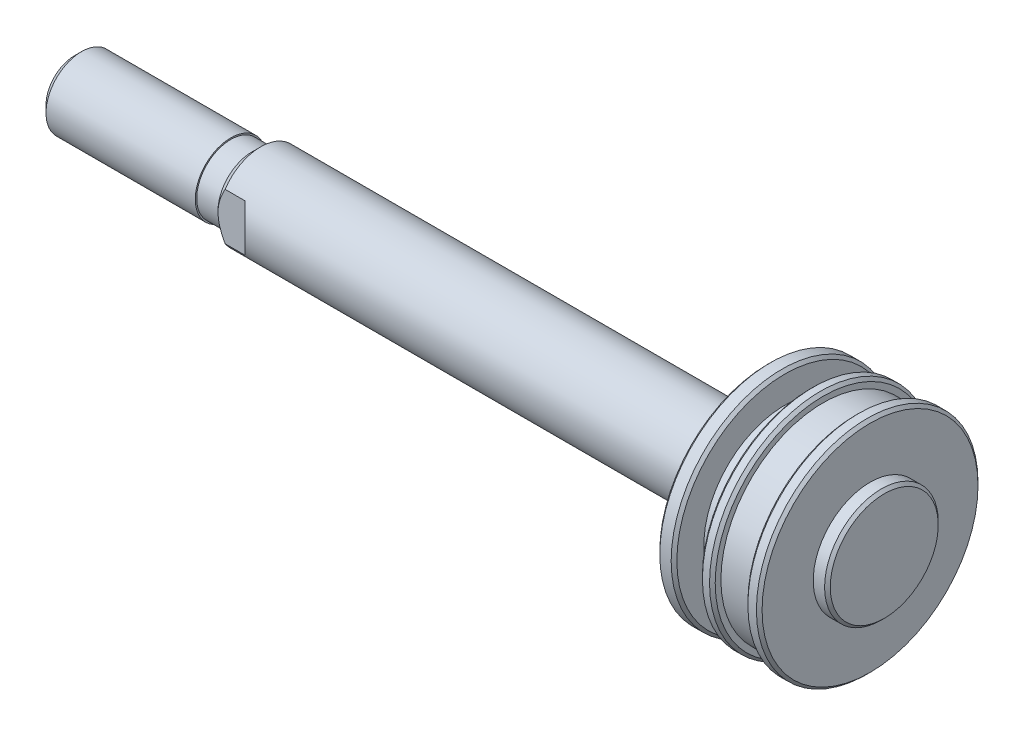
ISO-10303-21;
HEADER;
FILE_DESCRIPTION(('STEP AP214'),'2;1');
FILE_NAME('part.step','',(''),(''),'','','');
FILE_SCHEMA(('AUTOMOTIVE_DESIGN { 1 0 10303 214 1 1 1 1 }'));
ENDSEC;
DATA;
#1=APPLICATION_CONTEXT('core data for automotive mechanical design processes');
#2=APPLICATION_PROTOCOL_DEFINITION('international standard','automotive_design',2000,#1);
#3=PRODUCT_CONTEXT('',#1,'mechanical');
#4=PRODUCT('Part','Part','',(#3));
#5=PRODUCT_RELATED_PRODUCT_CATEGORY('part','',(#4));
#6=PRODUCT_DEFINITION_FORMATION('','',#4);
#7=PRODUCT_DEFINITION_CONTEXT('part definition',#1,'design');
#8=PRODUCT_DEFINITION('design','',#6,#7);
#9=PRODUCT_DEFINITION_SHAPE('','',#8);
#10=(LENGTH_UNIT() NAMED_UNIT(*) SI_UNIT(.MILLI.,.METRE.));
#11=(NAMED_UNIT(*) PLANE_ANGLE_UNIT() SI_UNIT($,.RADIAN.));
#12=(NAMED_UNIT(*) SI_UNIT($,.STERADIAN.) SOLID_ANGLE_UNIT());
#13=UNCERTAINTY_MEASURE_WITH_UNIT(LENGTH_MEASURE(1.E-05),#10,'distance_accuracy_value','');
#14=(GEOMETRIC_REPRESENTATION_CONTEXT(3) GLOBAL_UNCERTAINTY_ASSIGNED_CONTEXT((#13)) GLOBAL_UNIT_ASSIGNED_CONTEXT((#10,
#11,#12)) REPRESENTATION_CONTEXT('',''));
#15=CARTESIAN_POINT('',(0.,0.,0.));
#16=DIRECTION('',(0.,0.,1.));
#17=DIRECTION('',(1.,0.,0.));
#18=AXIS2_PLACEMENT_3D('',#15,#16,#17);
#19=CARTESIAN_POINT('',(41.,0.,1.9));
#20=DIRECTION('',(1.,0.,0.));
#21=DIRECTION('',(0.,0.,-1.));
#22=AXIS2_PLACEMENT_3D('',#19,#20,#21);
#23=PLANE('',#22);
#24=CARTESIAN_POINT('',(40.9999999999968,0.,0.));
#25=DIRECTION('',(-1.,0.,0.));
#26=DIRECTION('',(0.,0.,1.));
#27=AXIS2_PLACEMENT_3D('',#24,#25,#26);
#28=CIRCLE('',#27,3.80000000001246);
#29=CARTESIAN_POINT('',(40.9999999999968,0.,3.80000000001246));
#30=VERTEX_POINT('',#29);
#31=EDGE_CURVE('E19',#30,#30,#28,.T.);
#32=ORIENTED_EDGE('',*,*,#31,.F.);
#33=EDGE_LOOP('',(#32));
#34=FACE_BOUND('',#33,.T.);
#35=ADVANCED_FACE('F16',(#34),#23,.T.);
#36=CARTESIAN_POINT('',(40.800000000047,0.,0.));
#37=DIRECTION('',(-1.,0.,0.));
#38=DIRECTION('',(0.,0.,1.));
#39=AXIS2_PLACEMENT_3D('',#36,#37,#38);
#40=CONICAL_SURFACE('',#39,3.99999999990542,0.78539816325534);
#41=CARTESIAN_POINT('',(40.8,0.,0.));
#42=DIRECTION('',(1.,0.,0.));
#43=DIRECTION('',(0.,0.,-1.));
#44=AXIS2_PLACEMENT_3D('',#41,#42,#43);
#45=CIRCLE('',#44,4.);
#46=CARTESIAN_POINT('',(40.8,0.,-4.));
#47=VERTEX_POINT('',#46);
#48=EDGE_CURVE('E114',#47,#47,#45,.F.);
#49=ORIENTED_EDGE('',*,*,#48,.F.);
#50=EDGE_LOOP('',(#49));
#51=FACE_BOUND('',#50,.T.);
#52=ORIENTED_EDGE('',*,*,#31,.T.);
#53=EDGE_LOOP('',(#52));
#54=FACE_BOUND('',#53,.T.);
#55=ADVANCED_FACE('F230',(#51,#54),#40,.T.);
#56=CARTESIAN_POINT('',(40.4,0.,0.));
#57=DIRECTION('',(1.,0.,0.));
#58=DIRECTION('',(0.,0.,-1.));
#59=AXIS2_PLACEMENT_3D('',#56,#57,#58);
#60=CYLINDRICAL_SURFACE('',#59,4.);
#61=CARTESIAN_POINT('',(40.,0.,0.));
#62=DIRECTION('',(1.,0.,0.));
#63=DIRECTION('',(0.,0.,-1.));
#64=AXIS2_PLACEMENT_3D('',#61,#62,#63);
#65=CIRCLE('',#64,4.);
#66=CARTESIAN_POINT('',(40.,0.,-4.));
#67=VERTEX_POINT('',#66);
#68=EDGE_CURVE('E116',#67,#67,#65,.F.);
#69=ORIENTED_EDGE('',*,*,#68,.F.);
#70=EDGE_LOOP('',(#69));
#71=FACE_BOUND('',#70,.T.);
#72=ORIENTED_EDGE('',*,*,#48,.T.);
#73=EDGE_LOOP('',(#72));
#74=FACE_BOUND('',#73,.T.);
#75=ADVANCED_FACE('F227',(#71,#74),#60,.T.);
#76=CARTESIAN_POINT('',(40.,0.,5.8));
#77=DIRECTION('',(1.,0.,0.));
#78=DIRECTION('',(0.,0.,-1.));
#79=AXIS2_PLACEMENT_3D('',#76,#77,#78);
#80=PLANE('',#79);
#81=ORIENTED_EDGE('',*,*,#68,.T.);
#82=EDGE_LOOP('',(#81));
#83=FACE_BOUND('',#82,.T.);
#84=CARTESIAN_POINT('',(40.,0.,0.));
#85=DIRECTION('',(-1.,0.,0.));
#86=DIRECTION('',(0.,0.,1.));
#87=AXIS2_PLACEMENT_3D('',#84,#85,#86);
#88=CIRCLE('',#87,7.6);
#89=CARTESIAN_POINT('',(40.,0.,7.6));
#90=VERTEX_POINT('',#89);
#91=EDGE_CURVE('E113',#90,#90,#88,.T.);
#92=ORIENTED_EDGE('',*,*,#91,.F.);
#93=EDGE_LOOP('',(#92));
#94=FACE_BOUND('',#93,.T.);
#95=ADVANCED_FACE('F224',(#83,#94),#80,.T.);
#96=CARTESIAN_POINT('',(39.8,0.,0.));
#97=DIRECTION('',(-1.,0.,0.));
#98=DIRECTION('',(0.,0.,1.));
#99=AXIS2_PLACEMENT_3D('',#96,#97,#98);
#100=CONICAL_SURFACE('',#99,7.8,0.785398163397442);
#101=CARTESIAN_POINT('',(39.8,0.,0.));
#102=DIRECTION('',(1.,0.,0.));
#103=DIRECTION('',(0.,0.,-1.));
#104=AXIS2_PLACEMENT_3D('',#101,#102,#103);
#105=CIRCLE('',#104,7.8);
#106=CARTESIAN_POINT('',(39.8,0.,-7.8));
#107=VERTEX_POINT('',#106);
#108=EDGE_CURVE('E110',#107,#107,#105,.F.);
#109=ORIENTED_EDGE('',*,*,#108,.F.);
#110=EDGE_LOOP('',(#109));
#111=FACE_BOUND('',#110,.T.);
#112=ORIENTED_EDGE('',*,*,#91,.T.);
#113=EDGE_LOOP('',(#112));
#114=FACE_BOUND('',#113,.T.);
#115=ADVANCED_FACE('F263',(#111,#114),#100,.T.);
#116=CARTESIAN_POINT('',(39.5,0.,0.));
#117=DIRECTION('',(1.,0.,0.));
#118=DIRECTION('',(0.,0.,-1.));
#119=AXIS2_PLACEMENT_3D('',#116,#117,#118);
#120=CYLINDRICAL_SURFACE('',#119,7.8);
#121=CARTESIAN_POINT('',(39.2,0.,0.));
#122=DIRECTION('',(1.,0.,0.));
#123=DIRECTION('',(0.,0.,1.));
#124=AXIS2_PLACEMENT_3D('',#121,#122,#123);
#125=CIRCLE('',#124,7.8);
#126=CARTESIAN_POINT('',(39.2,0.,7.8));
#127=VERTEX_POINT('',#126);
#128=EDGE_CURVE('E106',#127,#127,#125,.F.);
#129=ORIENTED_EDGE('',*,*,#128,.F.);
#130=EDGE_LOOP('',(#129));
#131=FACE_BOUND('',#130,.T.);
#132=ORIENTED_EDGE('',*,*,#108,.T.);
#133=EDGE_LOOP('',(#132));
#134=FACE_BOUND('',#133,.T.);
#135=ADVANCED_FACE('F271',(#131,#134),#120,.T.);
#136=CARTESIAN_POINT('',(39.2,0.,0.));
#137=DIRECTION('',(1.,0.,0.));
#138=DIRECTION('',(0.,1.,0.));
#139=AXIS2_PLACEMENT_3D('',#136,#137,#138);
#140=CONICAL_SURFACE('',#139,7.8,0.785398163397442);
#141=CARTESIAN_POINT('',(39.,0.,0.));
#142=DIRECTION('',(1.,0.,0.));
#143=DIRECTION('',(0.,1.,0.));
#144=AXIS2_PLACEMENT_3D('',#141,#142,#143);
#145=CIRCLE('',#144,7.6);
#146=CARTESIAN_POINT('',(39.,7.6,0.));
#147=VERTEX_POINT('',#146);
#148=EDGE_CURVE('E109',#147,#147,#145,.F.);
#149=ORIENTED_EDGE('',*,*,#148,.F.);
#150=EDGE_LOOP('',(#149));
#151=FACE_BOUND('',#150,.T.);
#152=ORIENTED_EDGE('',*,*,#128,.T.);
#153=EDGE_LOOP('',(#152));
#154=FACE_BOUND('',#153,.T.);
#155=ADVANCED_FACE('F280',(#151,#154),#140,.T.);
#156=CARTESIAN_POINT('',(39.,0.,7.4));
#157=DIRECTION('',(-1.,0.,0.));
#158=DIRECTION('',(0.,0.,1.));
#159=AXIS2_PLACEMENT_3D('',#156,#157,#158);
#160=PLANE('',#159);
#161=ORIENTED_EDGE('',*,*,#148,.T.);
#162=EDGE_LOOP('',(#161));
#163=FACE_BOUND('',#162,.T.);
#164=CARTESIAN_POINT('',(39.,0.,0.));
#165=DIRECTION('',(1.,0.,0.));
#166=DIRECTION('',(0.,0.,-1.));
#167=AXIS2_PLACEMENT_3D('',#164,#165,#166);
#168=CIRCLE('',#167,7.2);
#169=CARTESIAN_POINT('',(39.,0.,-7.2));
#170=VERTEX_POINT('',#169);
#171=EDGE_CURVE('E215',#170,#170,#168,.F.);
#172=ORIENTED_EDGE('',*,*,#171,.F.);
#173=EDGE_LOOP('',(#172));
#174=FACE_BOUND('',#173,.T.);
#175=ADVANCED_FACE('F289',(#163,#174),#160,.T.);
#176=CARTESIAN_POINT('',(37.85,0.,0.));
#177=DIRECTION('',(1.,0.,0.));
#178=DIRECTION('',(0.,0.,-1.));
#179=AXIS2_PLACEMENT_3D('',#176,#177,#178);
#180=CYLINDRICAL_SURFACE('',#179,7.2);
#181=CARTESIAN_POINT('',(36.7,0.,0.));
#182=DIRECTION('',(1.,0.,0.));
#183=DIRECTION('',(0.,0.,-1.));
#184=AXIS2_PLACEMENT_3D('',#181,#182,#183);
#185=CIRCLE('',#184,7.2);
#186=CARTESIAN_POINT('',(36.7,0.,-7.2));
#187=VERTEX_POINT('',#186);
#188=EDGE_CURVE('E212',#187,#187,#185,.F.);
#189=ORIENTED_EDGE('',*,*,#188,.F.);
#190=EDGE_LOOP('',(#189));
#191=FACE_BOUND('',#190,.T.);
#192=ORIENTED_EDGE('',*,*,#171,.T.);
#193=EDGE_LOOP('',(#192));
#194=FACE_BOUND('',#193,.T.);
#195=ADVANCED_FACE('F298',(#191,#194),#180,.T.);
#196=CARTESIAN_POINT('',(36.7,0.,7.4));
#197=DIRECTION('',(1.,0.,0.));
#198=DIRECTION('',(0.,0.,-1.));
#199=AXIS2_PLACEMENT_3D('',#196,#197,#198);
#200=PLANE('',#199);
#201=ORIENTED_EDGE('',*,*,#188,.T.);
#202=EDGE_LOOP('',(#201));
#203=FACE_BOUND('',#202,.T.);
#204=CARTESIAN_POINT('',(36.7,0.,0.));
#205=DIRECTION('',(-1.,0.,0.));
#206=DIRECTION('',(0.,0.,1.));
#207=AXIS2_PLACEMENT_3D('',#204,#205,#206);
#208=CIRCLE('',#207,7.6);
#209=CARTESIAN_POINT('',(36.7,0.,7.6));
#210=VERTEX_POINT('',#209);
#211=EDGE_CURVE('E105',#210,#210,#208,.T.);
#212=ORIENTED_EDGE('',*,*,#211,.F.);
#213=EDGE_LOOP('',(#212));
#214=FACE_BOUND('',#213,.T.);
#215=ADVANCED_FACE('F307',(#203,#214),#200,.T.);
#216=CARTESIAN_POINT('',(36.5,0.,0.));
#217=DIRECTION('',(-1.,0.,0.));
#218=DIRECTION('',(0.,0.,1.));
#219=AXIS2_PLACEMENT_3D('',#216,#217,#218);
#220=CONICAL_SURFACE('',#219,7.8,0.785398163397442);
#221=CARTESIAN_POINT('',(36.5,0.,0.));
#222=DIRECTION('',(1.,0.,0.));
#223=DIRECTION('',(0.,0.,-1.));
#224=AXIS2_PLACEMENT_3D('',#221,#222,#223);
#225=CIRCLE('',#224,7.8);
#226=CARTESIAN_POINT('',(36.5,0.,-7.8));
#227=VERTEX_POINT('',#226);
#228=EDGE_CURVE('E102',#227,#227,#225,.F.);
#229=ORIENTED_EDGE('',*,*,#228,.F.);
#230=EDGE_LOOP('',(#229));
#231=FACE_BOUND('',#230,.T.);
#232=ORIENTED_EDGE('',*,*,#211,.T.);
#233=EDGE_LOOP('',(#232));
#234=FACE_BOUND('',#233,.T.);
#235=ADVANCED_FACE('F316',(#231,#234),#220,.T.);
#236=CARTESIAN_POINT('',(36.25,0.,0.));
#237=DIRECTION('',(1.,0.,0.));
#238=DIRECTION('',(0.,0.,-1.));
#239=AXIS2_PLACEMENT_3D('',#236,#237,#238);
#240=CYLINDRICAL_SURFACE('',#239,7.8);
#241=CARTESIAN_POINT('',(36.,0.,0.));
#242=DIRECTION('',(1.,0.,0.));
#243=DIRECTION('',(0.,0.,1.));
#244=AXIS2_PLACEMENT_3D('',#241,#242,#243);
#245=CIRCLE('',#244,7.8);
#246=CARTESIAN_POINT('',(36.,0.,7.8));
#247=VERTEX_POINT('',#246);
#248=EDGE_CURVE('E98',#247,#247,#245,.F.);
#249=ORIENTED_EDGE('',*,*,#248,.F.);
#250=EDGE_LOOP('',(#249));
#251=FACE_BOUND('',#250,.T.);
#252=ORIENTED_EDGE('',*,*,#228,.T.);
#253=EDGE_LOOP('',(#252));
#254=FACE_BOUND('',#253,.T.);
#255=ADVANCED_FACE('F325',(#251,#254),#240,.T.);
#256=CARTESIAN_POINT('',(36.,0.,0.));
#257=DIRECTION('',(1.,0.,0.));
#258=DIRECTION('',(0.,0.,-1.));
#259=AXIS2_PLACEMENT_3D('',#256,#257,#258);
#260=CONICAL_SURFACE('',#259,7.8,0.785398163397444);
#261=CARTESIAN_POINT('',(35.8,0.,0.));
#262=DIRECTION('',(1.,0.,0.));
#263=DIRECTION('',(0.,0.,-1.));
#264=AXIS2_PLACEMENT_3D('',#261,#262,#263);
#265=CIRCLE('',#264,7.6);
#266=CARTESIAN_POINT('',(35.8,0.,-7.6));
#267=VERTEX_POINT('',#266);
#268=EDGE_CURVE('E101',#267,#267,#265,.F.);
#269=ORIENTED_EDGE('',*,*,#268,.F.);
#270=EDGE_LOOP('',(#269));
#271=FACE_BOUND('',#270,.T.);
#272=ORIENTED_EDGE('',*,*,#248,.T.);
#273=EDGE_LOOP('',(#272));
#274=FACE_BOUND('',#273,.T.);
#275=ADVANCED_FACE('F334',(#271,#274),#260,.T.);
#276=CARTESIAN_POINT('',(35.8,0.,6.65));
#277=DIRECTION('',(-1.,0.,0.));
#278=DIRECTION('',(0.,0.,1.));
#279=AXIS2_PLACEMENT_3D('',#276,#277,#278);
#280=PLANE('',#279);
#281=ORIENTED_EDGE('',*,*,#268,.T.);
#282=EDGE_LOOP('',(#281));
#283=FACE_BOUND('',#282,.T.);
#284=CARTESIAN_POINT('',(35.8,0.,0.));
#285=DIRECTION('',(1.,0.,0.));
#286=DIRECTION('',(0.,0.,-1.));
#287=AXIS2_PLACEMENT_3D('',#284,#285,#286);
#288=CIRCLE('',#287,5.7);
#289=CARTESIAN_POINT('',(35.8,0.,-5.7));
#290=VERTEX_POINT('',#289);
#291=EDGE_CURVE('E205',#290,#290,#288,.F.);
#292=ORIENTED_EDGE('',*,*,#291,.F.);
#293=EDGE_LOOP('',(#292));
#294=FACE_BOUND('',#293,.T.);
#295=ADVANCED_FACE('F343',(#283,#294),#280,.T.);
#296=CARTESIAN_POINT('',(34.9,0.,0.));
#297=DIRECTION('',(1.,0.,0.));
#298=DIRECTION('',(0.,0.,-1.));
#299=AXIS2_PLACEMENT_3D('',#296,#297,#298);
#300=CYLINDRICAL_SURFACE('',#299,5.7);
#301=CARTESIAN_POINT('',(34.,0.,0.));
#302=DIRECTION('',(1.,0.,0.));
#303=DIRECTION('',(0.,0.,-1.));
#304=AXIS2_PLACEMENT_3D('',#301,#302,#303);
#305=CIRCLE('',#304,5.7);
#306=CARTESIAN_POINT('',(34.,0.,-5.7));
#307=VERTEX_POINT('',#306);
#308=EDGE_CURVE('E202',#307,#307,#305,.F.);
#309=ORIENTED_EDGE('',*,*,#308,.F.);
#310=EDGE_LOOP('',(#309));
#311=FACE_BOUND('',#310,.T.);
#312=ORIENTED_EDGE('',*,*,#291,.T.);
#313=EDGE_LOOP('',(#312));
#314=FACE_BOUND('',#313,.T.);
#315=ADVANCED_FACE('F352',(#311,#314),#300,.T.);
#316=CARTESIAN_POINT('',(34.,0.,6.65));
#317=DIRECTION('',(1.,0.,0.));
#318=DIRECTION('',(0.,0.,-1.));
#319=AXIS2_PLACEMENT_3D('',#316,#317,#318);
#320=PLANE('',#319);
#321=ORIENTED_EDGE('',*,*,#308,.T.);
#322=EDGE_LOOP('',(#321));
#323=FACE_BOUND('',#322,.T.);
#324=CARTESIAN_POINT('',(34.,0.,0.));
#325=DIRECTION('',(-1.,0.,0.));
#326=DIRECTION('',(0.,0.,1.));
#327=AXIS2_PLACEMENT_3D('',#324,#325,#326);
#328=CIRCLE('',#327,7.6);
#329=CARTESIAN_POINT('',(34.,0.,7.6));
#330=VERTEX_POINT('',#329);
#331=EDGE_CURVE('E97',#330,#330,#328,.T.);
#332=ORIENTED_EDGE('',*,*,#331,.F.);
#333=EDGE_LOOP('',(#332));
#334=FACE_BOUND('',#333,.T.);
#335=ADVANCED_FACE('F361',(#323,#334),#320,.T.);
#336=CARTESIAN_POINT('',(33.8,0.,0.));
#337=DIRECTION('',(-1.,0.,0.));
#338=DIRECTION('',(0.,0.,1.));
#339=AXIS2_PLACEMENT_3D('',#336,#337,#338);
#340=CONICAL_SURFACE('',#339,7.8,0.785398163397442);
#341=CARTESIAN_POINT('',(33.8,0.,0.));
#342=DIRECTION('',(1.,0.,0.));
#343=DIRECTION('',(0.,0.,-1.));
#344=AXIS2_PLACEMENT_3D('',#341,#342,#343);
#345=CIRCLE('',#344,7.8);
#346=CARTESIAN_POINT('',(33.8,0.,-7.8));
#347=VERTEX_POINT('',#346);
#348=EDGE_CURVE('E94',#347,#347,#345,.F.);
#349=ORIENTED_EDGE('',*,*,#348,.F.);
#350=EDGE_LOOP('',(#349));
#351=FACE_BOUND('',#350,.T.);
#352=ORIENTED_EDGE('',*,*,#331,.T.);
#353=EDGE_LOOP('',(#352));
#354=FACE_BOUND('',#353,.T.);
#355=ADVANCED_FACE('F370',(#351,#354),#340,.T.);
#356=CARTESIAN_POINT('',(-16.,0.,1.00475));
#357=DIRECTION('',(-1.,0.,0.));
#358=DIRECTION('',(0.,0.,1.));
#359=AXIS2_PLACEMENT_3D('',#356,#357,#358);
#360=PLANE('',#359);
#361=CARTESIAN_POINT('',(-16.0000000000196,0.,0.));
#362=DIRECTION('',(1.,0.,0.));
#363=DIRECTION('',(0.,1.,0.));
#364=AXIS2_PLACEMENT_3D('',#361,#362,#363);
#365=CIRCLE('',#364,2.00949999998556);
#366=CARTESIAN_POINT('',(-16.0000000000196,2.00949999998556,0.));
#367=VERTEX_POINT('',#366);
#368=EDGE_CURVE('E93',#367,#367,#365,.T.);
#369=ORIENTED_EDGE('',*,*,#368,.F.);
#370=EDGE_LOOP('',(#369));
#371=FACE_BOUND('',#370,.T.);
#372=ADVANCED_FACE('F379',(#371),#360,.T.);
#373=CARTESIAN_POINT('',(33.4,0.,0.));
#374=DIRECTION('',(1.,0.,0.));
#375=DIRECTION('',(0.,0.,-1.));
#376=AXIS2_PLACEMENT_3D('',#373,#374,#375);
#377=CYLINDRICAL_SURFACE('',#376,7.8);
#378=CARTESIAN_POINT('',(33.,0.,0.));
#379=DIRECTION('',(1.,0.,0.));
#380=DIRECTION('',(0.,0.,1.));
#381=AXIS2_PLACEMENT_3D('',#378,#379,#380);
#382=CIRCLE('',#381,7.8);
#383=CARTESIAN_POINT('',(33.,0.,7.8));
#384=VERTEX_POINT('',#383);
#385=EDGE_CURVE('E90',#384,#384,#382,.F.);
#386=ORIENTED_EDGE('',*,*,#385,.F.);
#387=EDGE_LOOP('',(#386));
#388=FACE_BOUND('',#387,.T.);
#389=ORIENTED_EDGE('',*,*,#348,.T.);
#390=EDGE_LOOP('',(#389));
#391=FACE_BOUND('',#390,.T.);
#392=ADVANCED_FACE('F388',(#388,#391),#377,.T.);
#393=CARTESIAN_POINT('',(-15.5095000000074,0.,0.));
#394=DIRECTION('',(1.,0.,0.));
#395=DIRECTION('',(0.,1.,0.));
#396=AXIS2_PLACEMENT_3D('',#393,#394,#395);
#397=CONICAL_SURFACE('',#396,2.50000000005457,0.785398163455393);
#398=ORIENTED_EDGE('',*,*,#368,.T.);
#399=EDGE_LOOP('',(#398));
#400=FACE_BOUND('',#399,.T.);
#401=CARTESIAN_POINT('',(-15.5095,0.,0.));
#402=DIRECTION('',(1.,0.,0.));
#403=DIRECTION('',(0.,0.,-1.));
#404=AXIS2_PLACEMENT_3D('',#401,#402,#403);
#405=CIRCLE('',#404,2.5);
#406=CARTESIAN_POINT('',(-15.5095,0.,-2.5));
#407=VERTEX_POINT('',#406);
#408=EDGE_CURVE('E86',#407,#407,#405,.T.);
#409=ORIENTED_EDGE('',*,*,#408,.F.);
#410=EDGE_LOOP('',(#409));
#411=FACE_BOUND('',#410,.T.);
#412=ADVANCED_FACE('F397',(#400,#411),#397,.T.);
#413=CARTESIAN_POINT('',(33.,0.,0.));
#414=DIRECTION('',(1.,0.,0.));
#415=DIRECTION('',(0.,0.,-1.));
#416=AXIS2_PLACEMENT_3D('',#413,#414,#415);
#417=CONICAL_SURFACE('',#416,7.8,0.785398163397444);
#418=CARTESIAN_POINT('',(32.8,0.,0.));
#419=DIRECTION('',(1.,0.,0.));
#420=DIRECTION('',(0.,0.,-1.));
#421=AXIS2_PLACEMENT_3D('',#418,#419,#420);
#422=CIRCLE('',#421,7.6);
#423=CARTESIAN_POINT('',(32.8,0.,-7.6));
#424=VERTEX_POINT('',#423);
#425=EDGE_CURVE('E89',#424,#424,#422,.F.);
#426=ORIENTED_EDGE('',*,*,#425,.F.);
#427=EDGE_LOOP('',(#426));
#428=FACE_BOUND('',#427,.T.);
#429=ORIENTED_EDGE('',*,*,#385,.T.);
#430=EDGE_LOOP('',(#429));
#431=FACE_BOUND('',#430,.T.);
#432=ADVANCED_FACE('F406',(#428,#431),#417,.T.);
#433=CARTESIAN_POINT('',(-10.25475,0.,0.));
#434=DIRECTION('',(1.,0.,0.));
#435=DIRECTION('',(0.,0.,-1.));
#436=AXIS2_PLACEMENT_3D('',#433,#434,#435);
#437=CYLINDRICAL_SURFACE('',#436,2.5);
#438=ORIENTED_EDGE('',*,*,#408,.T.);
#439=EDGE_LOOP('',(#438));
#440=FACE_BOUND('',#439,.T.);
#441=CARTESIAN_POINT('',(-5.,0.,0.));
#442=DIRECTION('',(1.,0.,0.));
#443=DIRECTION('',(0.,0.,-1.));
#444=AXIS2_PLACEMENT_3D('',#441,#442,#443);
#445=CIRCLE('',#444,2.5);
#446=CARTESIAN_POINT('',(-5.,0.,-2.5));
#447=VERTEX_POINT('',#446);
#448=EDGE_CURVE('E189',#447,#447,#445,.T.);
#449=ORIENTED_EDGE('',*,*,#448,.F.);
#450=EDGE_LOOP('',(#449));
#451=FACE_BOUND('',#450,.T.);
#452=ADVANCED_FACE('F415',(#440,#451),#437,.T.);
#453=CARTESIAN_POINT('',(32.8,0.,5.25));
#454=DIRECTION('',(-1.,0.,0.));
#455=DIRECTION('',(0.,0.,1.));
#456=AXIS2_PLACEMENT_3D('',#453,#454,#455);
#457=PLANE('',#456);
#458=ORIENTED_EDGE('',*,*,#425,.T.);
#459=EDGE_LOOP('',(#458));
#460=FACE_BOUND('',#459,.T.);
#461=CARTESIAN_POINT('',(32.8,0.,0.));
#462=DIRECTION('',(1.,0.,0.));
#463=DIRECTION('',(0.,0.,-1.));
#464=AXIS2_PLACEMENT_3D('',#461,#462,#463);
#465=CIRCLE('',#464,2.9);
#466=CARTESIAN_POINT('',(32.8,0.,-2.9));
#467=VERTEX_POINT('',#466);
#468=EDGE_CURVE('E186',#467,#467,#465,.F.);
#469=ORIENTED_EDGE('',*,*,#468,.F.);
#470=EDGE_LOOP('',(#469));
#471=FACE_BOUND('',#470,.T.);
#472=ADVANCED_FACE('F424',(#460,#471),#457,.T.);
#473=CARTESIAN_POINT('',(-5.,0.,2.45));
#474=DIRECTION('',(1.,0.,0.));
#475=DIRECTION('',(0.,0.,-1.));
#476=AXIS2_PLACEMENT_3D('',#473,#474,#475);
#477=PLANE('',#476);
#478=CARTESIAN_POINT('',(-5.,0.,0.));
#479=DIRECTION('',(1.,0.,0.));
#480=DIRECTION('',(0.,0.,-1.));
#481=AXIS2_PLACEMENT_3D('',#478,#479,#480);
#482=CIRCLE('',#481,2.4);
#483=CARTESIAN_POINT('',(-5.,0.,-2.4));
#484=VERTEX_POINT('',#483);
#485=EDGE_CURVE('E184',#484,#484,#482,.T.);
#486=ORIENTED_EDGE('',*,*,#485,.F.);
#487=EDGE_LOOP('',(#486));
#488=FACE_BOUND('',#487,.T.);
#489=ORIENTED_EDGE('',*,*,#448,.T.);
#490=EDGE_LOOP('',(#489));
#491=FACE_BOUND('',#490,.T.);
#492=ADVANCED_FACE('F433',(#488,#491),#477,.T.);
#493=CARTESIAN_POINT('',(32.2,0.,0.));
#494=DIRECTION('',(1.,0.,0.));
#495=DIRECTION('',(0.,0.,-1.));
#496=AXIS2_PLACEMENT_3D('',#493,#494,#495);
#497=CYLINDRICAL_SURFACE('',#496,2.9);
#498=CARTESIAN_POINT('',(31.6,0.,0.));
#499=DIRECTION('',(1.,0.,0.));
#500=DIRECTION('',(0.,0.,-1.));
#501=AXIS2_PLACEMENT_3D('',#498,#499,#500);
#502=CIRCLE('',#501,2.9);
#503=CARTESIAN_POINT('',(31.6,0.,-2.9));
#504=VERTEX_POINT('',#503);
#505=EDGE_CURVE('E78',#504,#504,#502,.F.);
#506=ORIENTED_EDGE('',*,*,#505,.F.);
#507=EDGE_LOOP('',(#506));
#508=FACE_BOUND('',#507,.T.);
#509=ORIENTED_EDGE('',*,*,#468,.T.);
#510=EDGE_LOOP('',(#509));
#511=FACE_BOUND('',#510,.T.);
#512=ADVANCED_FACE('F164',(#508,#511),#497,.T.);
#513=CARTESIAN_POINT('',(-1.5,-6.,-2.5));
#514=DIRECTION('',(0.,0.,1.));
#515=DIRECTION('',(1.,0.,0.));
#516=AXIS2_PLACEMENT_3D('',#513,#514,#515);
#517=PLANE('',#516);
#518=DIRECTION('',(0.,1.,0.));
#519=VECTOR('',#518,1.);
#520=CARTESIAN_POINT('',(-1.5,-6.,-2.5));
#521=LINE('',#520,#519);
#522=CARTESIAN_POINT('',(-1.5,1.6583123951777,-2.5));
#523=VERTEX_POINT('',#522);
#524=CARTESIAN_POINT('',(-1.5,-1.6583123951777,-2.5));
#525=VERTEX_POINT('',#524);
#526=EDGE_CURVE('E72',#523,#525,#521,.F.);
#527=ORIENTED_EDGE('',*,*,#526,.T.);
#528=DIRECTION('',(1.,0.,0.));
#529=VECTOR('',#528,1.);
#530=CARTESIAN_POINT('',(14.35,-1.6583123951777,-2.5));
#531=LINE('',#530,#529);
#532=CARTESIAN_POINT('',(-2.89999999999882,-1.65831239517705,-2.5));
#533=VERTEX_POINT('',#532);
#534=EDGE_CURVE('E69',#533,#525,#531,.T.);
#535=ORIENTED_EDGE('',*,*,#534,.F.);
#536=CARTESIAN_POINT('',(-2.8999999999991,1.65831239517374,-2.5));
#537=CARTESIAN_POINT('',(-2.92458615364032,1.61382941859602,-2.5));
#538=CARTESIAN_POINT('',(-2.94865019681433,1.56905834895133,-2.5));
#539=CARTESIAN_POINT('',(-2.99557417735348,1.4789095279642,-2.5));
#540=CARTESIAN_POINT('',(-3.0184345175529,1.43353198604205,-2.5));
#541=CARTESIAN_POINT('',(-3.08519386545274,1.29598840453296,-2.5));
#542=CARTESIAN_POINT('',(-3.12704779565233,1.20280974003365,-2.5));
#543=CARTESIAN_POINT('',(-3.20404527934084,1.01280380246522,-2.5));
#544=CARTESIAN_POINT('',(-3.23913174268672,0.915953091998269,-2.5));
#545=CARTESIAN_POINT('',(-3.30021148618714,0.719439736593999,-2.5));
#546=CARTESIAN_POINT('',(-3.32621190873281,0.619779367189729,-2.5));
#547=CARTESIAN_POINT('',(-3.36408090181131,0.433468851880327,-2.5));
#548=CARTESIAN_POINT('',(-3.37749399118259,0.347135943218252,-2.5));
#549=CARTESIAN_POINT('',(-3.39543527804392,0.173863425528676,-2.5));
#550=CARTESIAN_POINT('',(-3.39999772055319,0.0869274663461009,-2.5));
#551=CARTESIAN_POINT('',(-3.40000198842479,-0.0758294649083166,-2.5));
#552=CARTESIAN_POINT('',(-3.39653387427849,-0.151652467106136,-2.5));
#553=CARTESIAN_POINT('',(-3.38286385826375,-0.302712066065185,-2.5));
#554=CARTESIAN_POINT('',(-3.37265933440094,-0.377948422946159,-2.5));
#555=CARTESIAN_POINT('',(-3.34596560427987,-0.527795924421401,-2.5));
#556=CARTESIAN_POINT('',(-3.32943512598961,-0.602399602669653,-2.5));
#557=CARTESIAN_POINT('',(-3.29085061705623,-0.750168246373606,-2.5));
#558=CARTESIAN_POINT('',(-3.26879508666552,-0.823332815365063,-2.5));
#559=CARTESIAN_POINT('',(-3.22192151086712,-0.962309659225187,-2.5));
#560=CARTESIAN_POINT('',(-3.19746197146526,-1.02824437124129,-2.5));
#561=CARTESIAN_POINT('',(-3.14515851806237,-1.1587606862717,-2.5));
#562=CARTESIAN_POINT('',(-3.11731409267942,-1.22334208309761,-2.5));
#563=CARTESIAN_POINT('',(-3.0591744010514,-1.35034828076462,-2.5));
#564=CARTESIAN_POINT('',(-3.02891647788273,-1.41279031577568,-2.5));
#565=CARTESIAN_POINT('',(-2.96608899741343,-1.53644034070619,-2.5));
#566=CARTESIAN_POINT('',(-2.93352131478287,-1.59764928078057,-2.5));
#567=CARTESIAN_POINT('',(-2.89999999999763,-1.65831239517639,-2.5));
#568=B_SPLINE_CURVE_WITH_KNOTS('',3,(#536,#537,#538,#539,#540,#541,#542,#543,#544,#545,#546,
#547,#548,#549,#550,#551,#552,#553,#554,#555,#556,#557,#558,#559,#560,#561,#562,#563,#564,#565,
#566,#567),.UNSPECIFIED.,.F.,.F.,(4,2,2,2,2,2,2,2,2,2,2,2,2,2,2,4),(0.,0.152469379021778,
0.304887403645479,0.611091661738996,0.919775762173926,1.22821666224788,1.48991340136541,
1.75059554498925,1.97799648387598,2.20548598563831,2.43448570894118,2.66354766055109,
2.87441784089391,3.08531991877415,3.29342880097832,3.50137066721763),.UNSPECIFIED.);
#569=CARTESIAN_POINT('',(-2.89999999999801,1.65831239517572,-2.5));
#570=VERTEX_POINT('',#569);
#571=EDGE_CURVE('E58',#570,#533,#568,.T.);
#572=ORIENTED_EDGE('',*,*,#571,.F.);
#573=DIRECTION('',(1.,0.,0.));
#574=VECTOR('',#573,1.);
#575=CARTESIAN_POINT('',(-1.5,1.6583123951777,-2.5));
#576=LINE('',#575,#574);
#577=EDGE_CURVE('E185',#523,#570,#576,.F.);
#578=ORIENTED_EDGE('',*,*,#577,.F.);
#579=EDGE_LOOP('',(#527,#535,#572,#578));
#580=FACE_BOUND('',#579,.T.);
#581=ADVANCED_FACE('F70',(#580),#517,.F.);
#582=CARTESIAN_POINT('',(-4.25,0.,0.));
#583=DIRECTION('',(1.,0.,0.));
#584=DIRECTION('',(0.,0.,-1.));
#585=AXIS2_PLACEMENT_3D('',#582,#583,#584);
#586=CYLINDRICAL_SURFACE('',#585,2.4);
#587=ORIENTED_EDGE('',*,*,#485,.T.);
#588=EDGE_LOOP('',(#587));
#589=FACE_BOUND('',#588,.T.);
#590=CARTESIAN_POINT('',(-3.49999999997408,0.,0.));
#591=DIRECTION('',(1.,0.,0.));
#592=DIRECTION('',(0.,0.,1.));
#593=AXIS2_PLACEMENT_3D('',#590,#591,#592);
#594=CIRCLE('',#593,2.40000000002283);
#595=CARTESIAN_POINT('',(-3.49999999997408,0.,2.40000000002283));
#596=VERTEX_POINT('',#595);
#597=EDGE_CURVE('E65',#596,#596,#594,.T.);
#598=ORIENTED_EDGE('',*,*,#597,.F.);
#599=EDGE_LOOP('',(#598));
#600=FACE_BOUND('',#599,.T.);
#601=ADVANCED_FACE('F156',(#589,#600),#586,.T.);
#602=CARTESIAN_POINT('',(-18.5,-6.,2.5));
#603=DIRECTION('',(0.,0.,-1.));
#604=DIRECTION('',(-1.,0.,0.));
#605=AXIS2_PLACEMENT_3D('',#602,#603,#604);
#606=PLANE('',#605);
#607=CARTESIAN_POINT('',(-2.89999999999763,-1.65831239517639,2.5));
#608=CARTESIAN_POINT('',(-2.9245861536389,-1.61382941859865,2.5));
#609=CARTESIAN_POINT('',(-2.94865019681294,-1.56905834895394,2.5));
#610=CARTESIAN_POINT('',(-2.99557417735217,-1.47890952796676,2.5));
#611=CARTESIAN_POINT('',(-3.01843451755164,-1.43353198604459,2.5));
#612=CARTESIAN_POINT('',(-3.08519386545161,-1.29598840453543,2.5));
#613=CARTESIAN_POINT('',(-3.12704779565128,-1.20280974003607,2.5));
#614=CARTESIAN_POINT('',(-3.20404527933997,-1.01280380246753,2.5));
#615=CARTESIAN_POINT('',(-3.23913174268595,-0.915953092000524,2.5));
#616=CARTESIAN_POINT('',(-3.30021148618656,-0.719439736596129,2.5));
#617=CARTESIAN_POINT('',(-3.32621190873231,-0.619779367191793,2.5));
#618=CARTESIAN_POINT('',(-3.36408090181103,-0.433468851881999,2.5));
#619=CARTESIAN_POINT('',(-3.37749399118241,-0.347135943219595,2.5));
#620=CARTESIAN_POINT('',(-3.39543527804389,-0.173863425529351,2.5));
#621=CARTESIAN_POINT('',(-3.39999772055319,-0.0869274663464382,2.5));
#622=CARTESIAN_POINT('',(-3.40000198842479,0.0758294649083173,2.5));
#623=CARTESIAN_POINT('',(-3.39653387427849,0.151652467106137,2.5));
#624=CARTESIAN_POINT('',(-3.38286385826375,0.302712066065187,2.5));
#625=CARTESIAN_POINT('',(-3.37265933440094,0.377948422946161,2.5));
#626=CARTESIAN_POINT('',(-3.34596560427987,0.527795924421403,2.5));
#627=CARTESIAN_POINT('',(-3.32943512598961,0.602399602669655,2.5));
#628=CARTESIAN_POINT('',(-3.29085061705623,0.750168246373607,2.5));
#629=CARTESIAN_POINT('',(-3.26879508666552,0.823332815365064,2.5));
#630=CARTESIAN_POINT('',(-3.2219215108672,0.962309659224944,2.5));
#631=CARTESIAN_POINT('',(-3.19746197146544,1.02824437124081,2.5));
#632=CARTESIAN_POINT('',(-3.14515851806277,1.15876068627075,2.5));
#633=CARTESIAN_POINT('',(-3.11731409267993,1.22334208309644,2.5));
#634=CARTESIAN_POINT('',(-3.05917440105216,1.35034828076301,2.5));
#635=CARTESIAN_POINT('',(-3.02891647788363,1.41279031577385,2.5));
#636=CARTESIAN_POINT('',(-2.96608899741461,1.53644034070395,2.5));
#637=CARTESIAN_POINT('',(-2.93352131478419,1.59764928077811,2.5));
#638=CARTESIAN_POINT('',(-2.8999999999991,1.65831239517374,2.5));
#639=B_SPLINE_CURVE_WITH_KNOTS('',3,(#607,#608,#609,#610,#611,#612,#613,#614,#615,#616,#617,
#618,#619,#620,#621,#622,#623,#624,#625,#626,#627,#628,#629,#630,#631,#632,#633,#634,#635,#636,
#637,#638),.UNSPECIFIED.,.F.,.F.,(4,2,2,2,2,2,2,2,2,2,2,2,2,2,2,4),(0.,0.152469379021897,
0.304887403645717,0.611091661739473,0.919775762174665,1.22821666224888,1.48991340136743,
1.75059554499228,1.97799648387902,2.20548598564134,2.43448570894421,2.66354766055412,
2.87441784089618,3.08531991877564,3.29342880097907,3.50137066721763),.UNSPECIFIED.);
#640=CARTESIAN_POINT('',(-2.89999999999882,-1.65831239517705,2.5));
#641=VERTEX_POINT('',#640);
#642=CARTESIAN_POINT('',(-2.89999999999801,1.65831239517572,2.5));
#643=VERTEX_POINT('',#642);
#644=EDGE_CURVE('E52',#641,#643,#639,.T.);
#645=ORIENTED_EDGE('',*,*,#644,.F.);
#646=DIRECTION('',(1.,0.,0.));
#647=VECTOR('',#646,1.);
#648=CARTESIAN_POINT('',(14.35,-1.6583123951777,2.5));
#649=LINE('',#648,#647);
#650=CARTESIAN_POINT('',(-1.5,-1.6583123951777,2.5));
#651=VERTEX_POINT('',#650);
#652=EDGE_CURVE('E76',#651,#641,#649,.F.);
#653=ORIENTED_EDGE('',*,*,#652,.F.);
#654=DIRECTION('',(0.,1.,0.));
#655=VECTOR('',#654,1.);
#656=CARTESIAN_POINT('',(-1.5,-6.,2.5));
#657=LINE('',#656,#655);
#658=CARTESIAN_POINT('',(-1.5,1.6583123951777,2.5));
#659=VERTEX_POINT('',#658);
#660=EDGE_CURVE('E85',#651,#659,#657,.T.);
#661=ORIENTED_EDGE('',*,*,#660,.T.);
#662=DIRECTION('',(-1.,0.,0.));
#663=VECTOR('',#662,1.);
#664=CARTESIAN_POINT('',(-18.5,1.6583123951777,2.5));
#665=LINE('',#664,#663);
#666=EDGE_CURVE('E33',#643,#659,#665,.F.);
#667=ORIENTED_EDGE('',*,*,#666,.F.);
#668=EDGE_LOOP('',(#645,#653,#661,#667));
#669=FACE_BOUND('',#668,.T.);
#670=ADVANCED_FACE('F152',(#669),#606,.F.);
#671=CARTESIAN_POINT('',(31.6,0.,2.95));
#672=DIRECTION('',(1.,0.,0.));
#673=DIRECTION('',(0.,0.,-1.));
#674=AXIS2_PLACEMENT_3D('',#671,#672,#673);
#675=PLANE('',#674);
#676=ORIENTED_EDGE('',*,*,#505,.T.);
#677=EDGE_LOOP('',(#676));
#678=FACE_BOUND('',#677,.T.);
#679=CARTESIAN_POINT('',(31.6,0.,0.));
#680=DIRECTION('',(1.,0.,0.));
#681=DIRECTION('',(0.,0.,-1.));
#682=AXIS2_PLACEMENT_3D('',#679,#680,#681);
#683=CIRCLE('',#682,3.);
#684=CARTESIAN_POINT('',(31.6,0.,-3.));
#685=VERTEX_POINT('',#684);
#686=EDGE_CURVE('E120',#685,#685,#683,.F.);
#687=ORIENTED_EDGE('',*,*,#686,.F.);
#688=EDGE_LOOP('',(#687));
#689=FACE_BOUND('',#688,.T.);
#690=ADVANCED_FACE('F149',(#678,#689),#675,.T.);
#691=CARTESIAN_POINT('',(-1.,-6.,-3.));
#692=DIRECTION('',(0.707106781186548,0.,0.707106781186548));
#693=DIRECTION('',(0.707106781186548,0.,-0.707106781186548));
#694=AXIS2_PLACEMENT_3D('',#691,#692,#693);
#695=PLANE('',#694);
#696=ORIENTED_EDGE('',*,*,#526,.F.);
#697=CARTESIAN_POINT('',(-4.,0.,0.));
#698=DIRECTION('',(0.707106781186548,0.,0.707106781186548));
#699=DIRECTION('',(0.707106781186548,0.,-0.707106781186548));
#700=AXIS2_PLACEMENT_3D('',#697,#698,#699);
#701=ELLIPSE('',#700,4.24264068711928,3.);
#702=EDGE_CURVE('E118',#525,#523,#701,.T.);
#703=ORIENTED_EDGE('',*,*,#702,.F.);
#704=EDGE_LOOP('',(#696,#703));
#705=FACE_BOUND('',#704,.T.);
#706=ADVANCED_FACE('F143',(#705),#695,.F.);
#707=CARTESIAN_POINT('',(-2.900000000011,0.,0.));
#708=DIRECTION('',(1.,0.,0.));
#709=DIRECTION('',(0.,0.,-1.));
#710=AXIS2_PLACEMENT_3D('',#707,#708,#709);
#711=CONICAL_SURFACE('',#710,2.99999999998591,0.785398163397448);
#712=ORIENTED_EDGE('',*,*,#597,.T.);
#713=EDGE_LOOP('',(#712));
#714=FACE_BOUND('',#713,.T.);
#715=ORIENTED_EDGE('',*,*,#571,.T.);
#716=CARTESIAN_POINT('',(-2.9,0.,0.));
#717=DIRECTION('',(1.,0.,0.));
#718=DIRECTION('',(0.,0.,-1.));
#719=AXIS2_PLACEMENT_3D('',#716,#717,#718);
#720=CIRCLE('',#719,3.);
#721=EDGE_CURVE('E62',#641,#533,#720,.T.);
#722=ORIENTED_EDGE('',*,*,#721,.F.);
#723=ORIENTED_EDGE('',*,*,#644,.T.);
#724=CARTESIAN_POINT('',(-2.9,0.,0.));
#725=DIRECTION('',(1.,0.,0.));
#726=DIRECTION('',(0.,0.,-1.));
#727=AXIS2_PLACEMENT_3D('',#724,#725,#726);
#728=CIRCLE('',#727,3.);
#729=EDGE_CURVE('E25',#570,#643,#728,.T.);
#730=ORIENTED_EDGE('',*,*,#729,.F.);
#731=EDGE_LOOP('',(#715,#722,#723,#730));
#732=FACE_BOUND('',#731,.T.);
#733=ADVANCED_FACE('F60',(#714,#732),#711,.T.);
#734=CARTESIAN_POINT('',(-1.5,-6.,2.5));
#735=DIRECTION('',(0.707106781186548,0.,-0.707106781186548));
#736=DIRECTION('',(-0.707106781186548,0.,-0.707106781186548));
#737=AXIS2_PLACEMENT_3D('',#734,#735,#736);
#738=PLANE('',#737);
#739=ORIENTED_EDGE('',*,*,#660,.F.);
#740=CARTESIAN_POINT('',(-4.,0.,0.));
#741=DIRECTION('',(0.707106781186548,0.,-0.707106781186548));
#742=DIRECTION('',(0.707106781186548,0.,0.707106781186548));
#743=AXIS2_PLACEMENT_3D('',#740,#741,#742);
#744=ELLIPSE('',#743,4.24264068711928,3.);
#745=EDGE_CURVE('E11',#659,#651,#744,.T.);
#746=ORIENTED_EDGE('',*,*,#745,.F.);
#747=EDGE_LOOP('',(#739,#746));
#748=FACE_BOUND('',#747,.T.);
#749=ADVANCED_FACE('F142',(#748),#738,.F.);
#750=CARTESIAN_POINT('',(14.35,0.,0.));
#751=DIRECTION('',(1.,0.,0.));
#752=DIRECTION('',(0.,0.,-1.));
#753=AXIS2_PLACEMENT_3D('',#750,#751,#752);
#754=CYLINDRICAL_SURFACE('',#753,3.);
#755=ORIENTED_EDGE('',*,*,#686,.T.);
#756=EDGE_LOOP('',(#755));
#757=FACE_BOUND('',#756,.T.);
#758=ORIENTED_EDGE('',*,*,#666,.T.);
#759=ORIENTED_EDGE('',*,*,#745,.T.);
#760=ORIENTED_EDGE('',*,*,#652,.T.);
#761=ORIENTED_EDGE('',*,*,#721,.T.);
#762=ORIENTED_EDGE('',*,*,#534,.T.);
#763=ORIENTED_EDGE('',*,*,#702,.T.);
#764=ORIENTED_EDGE('',*,*,#577,.T.);
#765=ORIENTED_EDGE('',*,*,#729,.T.);
#766=EDGE_LOOP('',(#758,#759,#760,#761,#762,#763,#764,#765));
#767=FACE_BOUND('',#766,.T.);
#768=ADVANCED_FACE('F75',(#757,#767),#754,.T.);
#769=CLOSED_SHELL('',(#35,#55,#75,#95,#115,#135,#155,#175,#195,#215,#235,#255,#275,#295,#315,
#335,#355,#372,#392,#412,#432,#452,#472,#492,#512,#581,#601,#670,#690,#706,#733,#749,#768));
#770=MANIFOLD_SOLID_BREP('B1',#769);
#771=ADVANCED_BREP_SHAPE_REPRESENTATION('',(#18,#770),#14);
#772=SHAPE_DEFINITION_REPRESENTATION(#9,#771);
ENDSEC;
END-ISO-10303-21;
